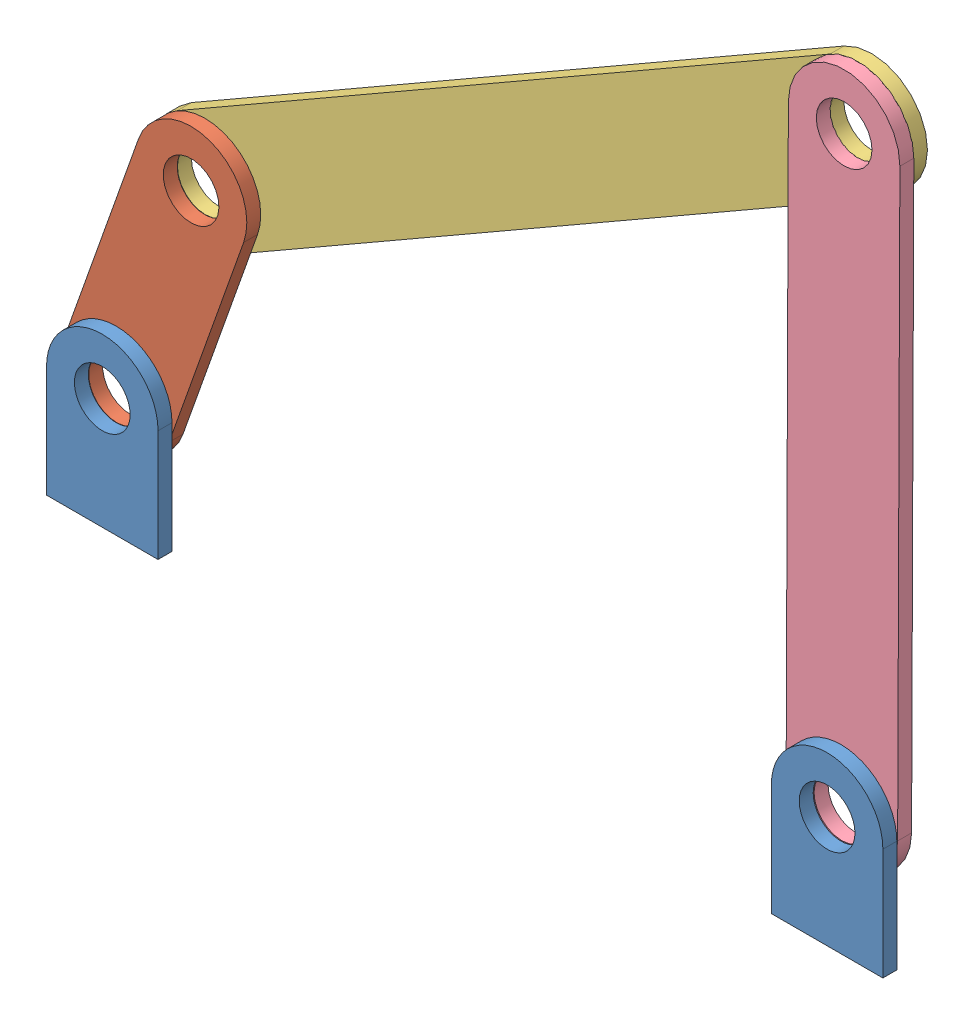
SolidWorks assembly 4bar1.sldasm, configuration Default (file format 4100). Lengths in mm.
Overall size (313.65 277.31 15.2).
5 component instances, 4 part files, 10 mates.
Components (placement in the parent):
- Part1-1: Part1.SLDPRT [Default] at origin size (40 60 5)
- Part1-2: Part1.SLDPRT [Default] at (260 0 0) size (40 60 5)
- Part2-1: Part2.SLDPRT [Default] at (-9.0079 66.3269 -5.1) x (0.33435 0.942449 0) z (0 0 1) size (120 40 5)
- Part3-1: Part3.SLDPRT [Default] at (196.9248 222.968 -10.2) x (0.866874 0.498528 0) z (0 0 1) size (310 40 5)
- Part4-1: Part4.SLDPRT [Default] at (238.6402 91.5186 -5.3) x (-0.003828 -0.999993 0) z (0 0 1) size (250 40 5)
Mates (geometry in assembly coordinates):
- Coincident1: coincident: plane of Part1-1 through (-20 40 5) normal (0 0 1); plane of Part1-2 through (240 40 5) normal (0 0 1)
- Coincident2: coincident: plane of Part1-1 through (0 0 5) normal (0 -1 0); plane of Part1-2 through (260 0 5) normal (0 -1 0)
- Distance1: distance = 220 mm: plane of Part1-2 through (220 0 5) normal (-1 0 0); plane of Part1-1 through (0 40 5) normal (1 0 0)
- Concentric1: concentric: cylinder of Part1-1 through (-20 40 0) axis (0 0 1) radius 10; cylinder of Part2-1 through (-20 40 -5.1) axis (0 0 1) radius 10
- Distance2: distance = 0.1 mm: plane of Part1-1 through (-20 40 0) normal (0 0 -1); plane of Part2-1 through (6.748 115.3959 -0.1) normal (0 0 1)
- Concentric2: concentric: cylinder of Part2-1 through (6.748 115.3959 -5.1) axis (0 0 1) radius 10; cylinder of Part3-1 through (6.748 115.3959 -10.2) axis (0 0 1) radius 10
- Distance3: distance = 0.1 mm: plane of Part2-1 through (6.748 115.3959 -5.1) normal (0 0 -1); plane of Part3-1 through (240.8039 249.9985 -5.2) normal (0 0 1)
- Concentric3: concentric: cylinder of Part3-1 through (240.8039 249.9985 -10.2) axis (0 0 1) radius 10; cylinder of Part4-1 through (240.8039 249.9985 -5.3) axis (0 0 1) radius 10
- Distance4: distance = 0.1 mm: plane of Part3-1 through (240.8039 249.9985 -5.2) normal (0 0 1); plane of Part4-1 through (240 40 -5.3) normal (0 0 -1)
- Concentric4: concentric: cylinder of Part1-2 through (240 40 0) axis (0 0 1) radius 10; cylinder of Part4-1 through (240 40 -5.3) axis (0 0 1) radius 10
